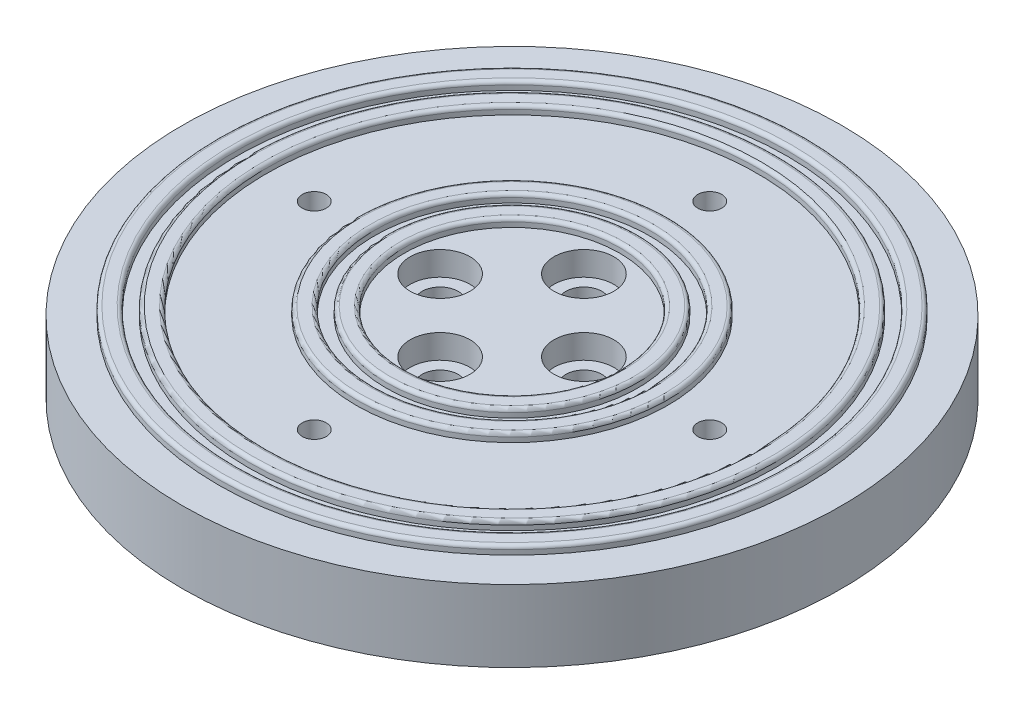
from build123d import *

# Parameters (mm, degrees)
SKETCH1_R           = 27.5
SKETCH1_R_2         = 1
SKETCH1_R_3         = 1.5
BOSS_EXTRUDE1_DEPTH = 6
SKETCH3_R           = 2.5
CUT_EXTRUDE2_DEPTH  = 2
SKETCH4_R           = 24.5
SKETCH4_R_2         = 23
SKETCH4_R_3         = 22
SKETCH4_R_4         = 20.5
SKETCH4_R_5         = 13
SKETCH4_R_6         = 11.5
SKETCH4_R_7         = 10.5
SKETCH4_R_8         = 9
BOSS_EXTRUDE2_DEPTH = 0.7
FILLET1_R           = 0.3


with BuildPart() as part:
    # Sketch1 (on Top Plane) → Boss-Extrude1 (new body)
    with BuildSketch(Plane(origin=(0, 0, 0), x_dir=(1, 0, 0), z_dir=(0, 1, 0))):
        with Locations(Location((0, 0, 0), (0, 0, 270))):
            Circle(SKETCH1_R)
        with Locations(Location((16.5, 0, 0), (0, 0, 270))):
            Circle(SKETCH1_R_2, mode=Mode.SUBTRACT)
        with Locations(Location((0, -16.5, 0), (0, 0, 270))):
            Circle(SKETCH1_R_2, mode=Mode.SUBTRACT)
        with Locations(Location((-16.5, 0, 0), (0, 0, 270))):
            Circle(SKETCH1_R_2, mode=Mode.SUBTRACT)
        with Locations(Location((0, 16.5, 0), (0, 0, 270))):
            Circle(SKETCH1_R_2, mode=Mode.SUBTRACT)
        with Locations(Location((0, 6, 0), (0, 0, 270))):
            Circle(SKETCH1_R_3, mode=Mode.SUBTRACT)
        with Locations(Location((6, 0, 0), (0, 0, 270))):
            Circle(SKETCH1_R_3, mode=Mode.SUBTRACT)
        with Locations(Location((0, -6, 0), (0, 0, 270))):
            Circle(SKETCH1_R_3, mode=Mode.SUBTRACT)
        with Locations(Location((-6, 0, 0), (0, 0, 270))):
            Circle(SKETCH1_R_3, mode=Mode.SUBTRACT)
    extrude(amount=-BOSS_EXTRUDE1_DEPTH)

    # Sketch3 → Cut-Extrude2 (cut)
    with BuildSketch(Plane(origin=(0, 0, 0), x_dir=(1, 0, 0), z_dir=(0, 1, 0))):
        with Locations(Location((0, -6, 0), (0, 0, 270))):
            Circle(SKETCH3_R)
        with Locations(Location((6, 0, 0), (0, 0, 270))):
            Circle(SKETCH3_R)
        with Locations(Location((-6, 0, 0), (0, 0, 270))):
            Circle(SKETCH3_R)
        with Locations(Location((0, 6, 0), (0, 0, 270))):
            Circle(SKETCH3_R)
    extrude(amount=-CUT_EXTRUDE2_DEPTH, mode=Mode.SUBTRACT)

    # Sketch4 → Boss-Extrude2 (add)
    # profile 1 of 4: a face of its own
    with BuildSketch(Plane(origin=(0, 0, 0), x_dir=(1, 0, 0), z_dir=(0, 1, 0))):
        with Locations(Location((0, 0, 0), (0, 0, 270))):
            Circle(SKETCH4_R)
        with Locations(Location((0, 0, 0), (0, 0, 270))):
            Circle(SKETCH4_R_2, mode=Mode.SUBTRACT)
    # profile 2 of 4: a face of its own
    with BuildSketch(Plane(origin=(0, 0, 0), x_dir=(1, 0, 0), z_dir=(0, 1, 0))):
        with Locations(Location((0, 0, 0), (0, 0, 270))):
            Circle(SKETCH4_R_3)
        with Locations(Location((0, 0, 0), (0, 0, 270))):
            Circle(SKETCH4_R_4, mode=Mode.SUBTRACT)
    # profile 3 of 4: a face of its own
    with BuildSketch(Plane(origin=(0, 0, 0), x_dir=(1, 0, 0), z_dir=(0, 1, 0))):
        with Locations(Location((0, 0, 0), (0, 0, 270))):
            Circle(SKETCH4_R_5)
        with Locations(Location((0, 0, 0), (0, 0, 270))):
            Circle(SKETCH4_R_6, mode=Mode.SUBTRACT)
    # profile 4 of 4: a face of its own
    with BuildSketch(Plane(origin=(0, 0, 0), x_dir=(1, 0, 0), z_dir=(0, 1, 0))):
        with Locations(Location((0, 0, 0), (0, 0, 270))):
            Circle(SKETCH4_R_7)
        with Locations(Location((0, 0, 0), (0, 0, 270))):
            Circle(SKETCH4_R_8, mode=Mode.SUBTRACT)
    extrude(amount=BOSS_EXTRUDE2_DEPTH)

    # Fillet1
    fillet1_edges = [part.edges().sort_by_distance(p)[0] for p in [
        (0, 0.7, -23),
        (0, 0.7, -24.5),
        (0, 0.7, -20.5),
        (0, 0.7, -22),
        (0, 0.7, -11.5),
        (0, 0.7, -13),
        (0, 0.7, -9),
        (0, 0.7, -10.5),
    ]]
    fillet(fillet1_edges, radius=FILLET1_R)


solid = part.part
